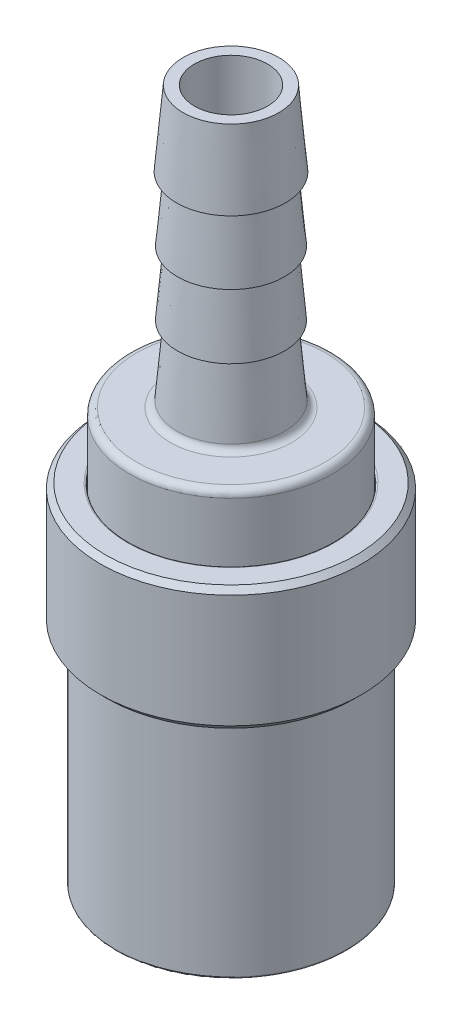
ISO-10303-21;
HEADER;
FILE_DESCRIPTION(('STEP AP214'),'2;1');
FILE_NAME('part.step','',(''),(''),'','','');
FILE_SCHEMA(('AUTOMOTIVE_DESIGN { 1 0 10303 214 1 1 1 1 }'));
ENDSEC;
DATA;
#1=APPLICATION_CONTEXT('core data for automotive mechanical design processes');
#2=APPLICATION_PROTOCOL_DEFINITION('international standard','automotive_design',2000,#1);
#3=PRODUCT_CONTEXT('',#1,'mechanical');
#4=PRODUCT('Part','Part','',(#3));
#5=PRODUCT_RELATED_PRODUCT_CATEGORY('part','',(#4));
#6=PRODUCT_DEFINITION_FORMATION('','',#4);
#7=PRODUCT_DEFINITION_CONTEXT('part definition',#1,'design');
#8=PRODUCT_DEFINITION('design','',#6,#7);
#9=PRODUCT_DEFINITION_SHAPE('','',#8);
#10=(LENGTH_UNIT() NAMED_UNIT(*) SI_UNIT(.MILLI.,.METRE.));
#11=(NAMED_UNIT(*) PLANE_ANGLE_UNIT() SI_UNIT($,.RADIAN.));
#12=(NAMED_UNIT(*) SI_UNIT($,.STERADIAN.) SOLID_ANGLE_UNIT());
#13=UNCERTAINTY_MEASURE_WITH_UNIT(LENGTH_MEASURE(1.E-05),#10,'distance_accuracy_value','');
#14=(GEOMETRIC_REPRESENTATION_CONTEXT(3) GLOBAL_UNCERTAINTY_ASSIGNED_CONTEXT((#13)) GLOBAL_UNIT_ASSIGNED_CONTEXT((#10,
#11,#12)) REPRESENTATION_CONTEXT('',''));
#15=CARTESIAN_POINT('',(0.,0.,0.));
#16=DIRECTION('',(0.,0.,1.));
#17=DIRECTION('',(1.,0.,0.));
#18=AXIS2_PLACEMENT_3D('',#15,#16,#17);
#19=CARTESIAN_POINT('',(0.,30.1498,-7.4041));
#20=DIRECTION('',(0.,1.,0.));
#21=DIRECTION('',(1.,0.,0.));
#22=AXIS2_PLACEMENT_3D('',#19,#20,#21);
#23=PLANE('',#22);
#24=CARTESIAN_POINT('',(0.,30.1498,0.));
#25=DIRECTION('',(0.,1.,0.));
#26=DIRECTION('',(0.,0.,1.));
#27=AXIS2_PLACEMENT_3D('',#24,#25,#26);
#28=CIRCLE('',#27,4.438540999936);
#29=CARTESIAN_POINT('',(0.,30.1498,4.438540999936));
#30=VERTEX_POINT('',#29);
#31=EDGE_CURVE('P0_E387',#30,#30,#28,.T.);
#32=ORIENTED_EDGE('',*,*,#31,.F.);
#33=EDGE_LOOP('',(#32));
#34=FACE_BOUND('',#33,.T.);
#35=CARTESIAN_POINT('',(0.,30.1498,0.));
#36=DIRECTION('',(0.,-1.,0.));
#37=DIRECTION('',(0.,0.,1.));
#38=AXIS2_PLACEMENT_3D('',#35,#36,#37);
#39=CIRCLE('',#38,6.8961);
#40=CARTESIAN_POINT('',(0.,30.1498,-6.8961));
#41=VERTEX_POINT('',#40);
#42=CARTESIAN_POINT('',(0.,30.1498,6.8961));
#43=VERTEX_POINT('',#42);
#44=EDGE_CURVE('P0_E32',#41,#43,#39,.T.);
#45=ORIENTED_EDGE('',*,*,#44,.F.);
#46=CARTESIAN_POINT('',(0.,30.1498,0.));
#47=DIRECTION('',(0.,-1.,0.));
#48=DIRECTION('',(0.,0.,1.));
#49=AXIS2_PLACEMENT_3D('',#46,#47,#48);
#50=CIRCLE('',#49,6.8961);
#51=EDGE_CURVE('P0_E170',#43,#41,#50,.T.);
#52=ORIENTED_EDGE('',*,*,#51,.F.);
#53=EDGE_LOOP('',(#45,#52));
#54=FACE_BOUND('',#53,.T.);
#55=ADVANCED_FACE('P0_F16',(#34,#54),#23,.T.);
#56=CARTESIAN_POINT('',(0.,29.6418,0.));
#57=DIRECTION('',(0.,-1.,0.));
#58=DIRECTION('',(0.,0.,-1.));
#59=AXIS2_PLACEMENT_3D('',#56,#57,#58);
#60=TOROIDAL_SURFACE('',#59,6.8961,0.508);
#61=CARTESIAN_POINT('',(0.,29.6418,0.));
#62=DIRECTION('',(0.,1.,0.));
#63=DIRECTION('',(0.,0.,1.));
#64=AXIS2_PLACEMENT_3D('',#61,#62,#63);
#65=CIRCLE('',#64,7.4041);
#66=CARTESIAN_POINT('',(0.,29.6418,-7.4041));
#67=VERTEX_POINT('',#66);
#68=CARTESIAN_POINT('',(0.,29.6418,7.4041));
#69=VERTEX_POINT('',#68);
#70=EDGE_CURVE('P0_E169',#67,#69,#65,.T.);
#71=ORIENTED_EDGE('',*,*,#70,.T.);
#72=CARTESIAN_POINT('',(0.,29.6418,6.8961));
#73=DIRECTION('',(-1.,0.,0.));
#74=DIRECTION('',(0.,0.,1.));
#75=AXIS2_PLACEMENT_3D('',#72,#73,#74);
#76=CIRCLE('',#75,0.508);
#77=EDGE_CURVE('P0_E166',#69,#43,#76,.T.);
#78=ORIENTED_EDGE('',*,*,#77,.T.);
#79=ORIENTED_EDGE('',*,*,#51,.T.);
#80=ORIENTED_EDGE('',*,*,#44,.T.);
#81=ORIENTED_EDGE('',*,*,#77,.F.);
#82=CARTESIAN_POINT('',(0.,29.6418,0.));
#83=DIRECTION('',(0.,1.,0.));
#84=DIRECTION('',(0.,0.,1.));
#85=AXIS2_PLACEMENT_3D('',#82,#83,#84);
#86=CIRCLE('',#85,7.4041);
#87=EDGE_CURVE('P0_E157',#69,#67,#86,.T.);
#88=ORIENTED_EDGE('',*,*,#87,.T.);
#89=EDGE_LOOP('',(#71,#78,#79,#80,#81,#88));
#90=FACE_BOUND('',#89,.T.);
#91=ADVANCED_FACE('P0_F310',(#90),#60,.T.);
#92=CARTESIAN_POINT('',(0.,22.6949,0.));
#93=DIRECTION('',(0.,-1.,0.));
#94=DIRECTION('',(0.,0.,-1.));
#95=AXIS2_PLACEMENT_3D('',#92,#93,#94);
#96=CYLINDRICAL_SURFACE('',#95,7.4041);
#97=DIRECTION('',(0.,1.,0.));
#98=VECTOR('',#97,1.);
#99=CARTESIAN_POINT('',(0.,22.6949,7.4041));
#100=LINE('',#99,#98);
#101=CARTESIAN_POINT('',(0.,15.24,7.4041));
#102=VERTEX_POINT('',#101);
#103=CARTESIAN_POINT('',(0.,25.3999996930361,7.4041));
#104=VERTEX_POINT('',#103);
#105=EDGE_CURVE('P0_E200',#102,#104,#100,.T.);
#106=ORIENTED_EDGE('',*,*,#105,.T.);
#107=ORIENTED_EDGE('',*,*,#105,.F.);
#108=CARTESIAN_POINT('',(0.,15.24,0.));
#109=DIRECTION('',(0.,-1.,0.));
#110=DIRECTION('',(1.,0.,0.));
#111=AXIS2_PLACEMENT_3D('',#108,#109,#110);
#112=CIRCLE('',#111,7.4041);
#113=CARTESIAN_POINT('',(0.,15.24,-7.4041));
#114=VERTEX_POINT('',#113);
#115=EDGE_CURVE('P0_E152',#114,#102,#112,.T.);
#116=ORIENTED_EDGE('',*,*,#115,.F.);
#117=CARTESIAN_POINT('',(0.,15.24,0.));
#118=DIRECTION('',(0.,-1.,0.));
#119=DIRECTION('',(1.,0.,0.));
#120=AXIS2_PLACEMENT_3D('',#117,#118,#119);
#121=CIRCLE('',#120,7.4041);
#122=EDGE_CURVE('P0_E148',#102,#114,#121,.T.);
#123=ORIENTED_EDGE('',*,*,#122,.F.);
#124=EDGE_LOOP('',(#106,#107,#116,#123));
#125=FACE_BOUND('',#124,.T.);
#126=DIRECTION('',(0.,1.,0.));
#127=VECTOR('',#126,1.);
#128=CARTESIAN_POINT('',(0.,22.6949,7.4041));
#129=LINE('',#128,#127);
#130=CARTESIAN_POINT('',(0.,28.1939996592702,7.4041));
#131=VERTEX_POINT('',#130);
#132=EDGE_CURVE('P0_E202',#131,#69,#129,.T.);
#133=ORIENTED_EDGE('',*,*,#132,.F.);
#134=ORIENTED_EDGE('',*,*,#132,.T.);
#135=ORIENTED_EDGE('',*,*,#70,.F.);
#136=ORIENTED_EDGE('',*,*,#87,.F.);
#137=EDGE_LOOP('',(#133,#134,#135,#136));
#138=FACE_BOUND('',#137,.T.);
#139=ADVANCED_FACE('P0_F306',(#125,#138),#96,.T.);
#140=CARTESIAN_POINT('',(0.,0.3937,0.));
#141=DIRECTION('',(0.,-1.,0.));
#142=DIRECTION('',(0.,0.,1.));
#143=AXIS2_PLACEMENT_3D('',#140,#141,#142);
#144=CONICAL_SURFACE('',#143,5.1689,0.785398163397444);
#145=CARTESIAN_POINT('',(0.,0.7874,0.));
#146=DIRECTION('',(0.,1.,0.));
#147=DIRECTION('',(0.,0.,1.));
#148=AXIS2_PLACEMENT_3D('',#145,#146,#147);
#149=CIRCLE('',#148,4.7752);
#150=CARTESIAN_POINT('',(0.,0.7874,-4.7752));
#151=VERTEX_POINT('',#150);
#152=CARTESIAN_POINT('',(0.,0.7874,4.7752));
#153=VERTEX_POINT('',#152);
#154=EDGE_CURVE('P0_E219',#151,#153,#149,.T.);
#155=ORIENTED_EDGE('',*,*,#154,.T.);
#156=CARTESIAN_POINT('',(0.,0.7874,0.));
#157=DIRECTION('',(0.,1.,0.));
#158=DIRECTION('',(0.,0.,1.));
#159=AXIS2_PLACEMENT_3D('',#156,#157,#158);
#160=CIRCLE('',#159,4.7752);
#161=EDGE_CURVE('P0_E254',#153,#151,#160,.T.);
#162=ORIENTED_EDGE('',*,*,#161,.T.);
#163=DIRECTION('',(0.,-0.70710678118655,-0.707106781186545));
#164=VECTOR('',#163,1.);
#165=CARTESIAN_POINT('',(0.,0.3937,-5.1689));
#166=LINE('',#165,#164);
#167=CARTESIAN_POINT('',(0.,0.,-5.5626));
#168=VERTEX_POINT('',#167);
#169=EDGE_CURVE('P0_E189',#151,#168,#166,.T.);
#170=ORIENTED_EDGE('',*,*,#169,.T.);
#171=CARTESIAN_POINT('',(0.,0.,0.));
#172=DIRECTION('',(0.,-1.,0.));
#173=DIRECTION('',(0.,0.,1.));
#174=AXIS2_PLACEMENT_3D('',#171,#172,#173);
#175=CIRCLE('',#174,5.5626);
#176=EDGE_CURVE('P0_E144',#168,#168,#175,.T.);
#177=ORIENTED_EDGE('',*,*,#176,.T.);
#178=ORIENTED_EDGE('',*,*,#169,.F.);
#179=EDGE_LOOP('',(#155,#162,#170,#177,#178));
#180=FACE_BOUND('',#179,.T.);
#181=ADVANCED_FACE('P0_F297',(#180),#144,.F.);
#182=CARTESIAN_POINT('',(0.,0.,-4.7752));
#183=DIRECTION('',(0.,-1.,0.));
#184=DIRECTION('',(0.,0.,-1.));
#185=AXIS2_PLACEMENT_3D('',#182,#183,#184);
#186=PLANE('',#185);
#187=CARTESIAN_POINT('',(0.,0.,0.));
#188=DIRECTION('',(0.,-1.,0.));
#189=DIRECTION('',(1.,0.,0.));
#190=AXIS2_PLACEMENT_3D('',#187,#188,#189);
#191=CIRCLE('',#190,6.35);
#192=CARTESIAN_POINT('',(0.,0.,-6.35));
#193=VERTEX_POINT('',#192);
#194=CARTESIAN_POINT('',(0.,0.,6.35));
#195=VERTEX_POINT('',#194);
#196=EDGE_CURVE('P0_E138',#193,#195,#191,.T.);
#197=ORIENTED_EDGE('',*,*,#196,.T.);
#198=CARTESIAN_POINT('',(0.,0.,0.));
#199=DIRECTION('',(0.,-1.,0.));
#200=DIRECTION('',(1.,0.,0.));
#201=AXIS2_PLACEMENT_3D('',#198,#199,#200);
#202=CIRCLE('',#201,6.35);
#203=EDGE_CURVE('P0_E132',#195,#193,#202,.T.);
#204=ORIENTED_EDGE('',*,*,#203,.T.);
#205=EDGE_LOOP('',(#197,#204));
#206=FACE_BOUND('',#205,.T.);
#207=ORIENTED_EDGE('',*,*,#176,.F.);
#208=EDGE_LOOP('',(#207));
#209=FACE_BOUND('',#208,.T.);
#210=ADVANCED_FACE('P0_F142',(#206,#209),#186,.T.);
#211=CARTESIAN_POINT('',(0.,4.05954229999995,0.));
#212=DIRECTION('',(0.,-1.,0.));
#213=DIRECTION('',(0.,0.,-1.));
#214=AXIS2_PLACEMENT_3D('',#211,#212,#213);
#215=CYLINDRICAL_SURFACE('',#214,4.7752);
#216=ORIENTED_EDGE('',*,*,#154,.F.);
#217=ORIENTED_EDGE('',*,*,#161,.F.);
#218=DIRECTION('',(0.,1.,0.));
#219=VECTOR('',#218,1.);
#220=CARTESIAN_POINT('',(0.,4.05954229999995,4.7752));
#221=LINE('',#220,#219);
#222=CARTESIAN_POINT('',(0.,8.1190845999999,4.7752));
#223=VERTEX_POINT('',#222);
#224=EDGE_CURVE('P0_E140',#153,#223,#221,.T.);
#225=ORIENTED_EDGE('',*,*,#224,.T.);
#226=CARTESIAN_POINT('',(0.,8.11908459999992,0.));
#227=DIRECTION('',(0.,-1.,0.));
#228=DIRECTION('',(1.,0.,0.));
#229=AXIS2_PLACEMENT_3D('',#226,#227,#228);
#230=CIRCLE('',#229,4.7752);
#231=CARTESIAN_POINT('',(0.,8.11908459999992,-4.7752));
#232=VERTEX_POINT('',#231);
#233=EDGE_CURVE('P0_E160',#232,#223,#230,.T.);
#234=ORIENTED_EDGE('',*,*,#233,.F.);
#235=CARTESIAN_POINT('',(0.,8.11908459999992,0.));
#236=DIRECTION('',(0.,-1.,0.));
#237=DIRECTION('',(1.,0.,0.));
#238=AXIS2_PLACEMENT_3D('',#235,#236,#237);
#239=CIRCLE('',#238,4.7752);
#240=EDGE_CURVE('P0_E237',#223,#232,#239,.T.);
#241=ORIENTED_EDGE('',*,*,#240,.F.);
#242=ORIENTED_EDGE('',*,*,#224,.F.);
#243=EDGE_LOOP('',(#216,#217,#225,#234,#241,#242));
#244=FACE_BOUND('',#243,.T.);
#245=ADVANCED_FACE('P0_F291',(#244),#215,.F.);
#246=CARTESIAN_POINT('',(0.,12.8524,-3.3782));
#247=DIRECTION('',(0.,-1.,0.));
#248=DIRECTION('',(0.,0.,-1.));
#249=AXIS2_PLACEMENT_3D('',#246,#247,#248);
#250=PLANE('',#249);
#251=CARTESIAN_POINT('',(0.,12.8524,0.));
#252=DIRECTION('',(0.,-1.,0.));
#253=DIRECTION('',(1.,0.,0.));
#254=AXIS2_PLACEMENT_3D('',#251,#252,#253);
#255=CIRCLE('',#254,5.0546);
#256=CARTESIAN_POINT('',(0.,12.8524,-5.0546));
#257=VERTEX_POINT('',#256);
#258=CARTESIAN_POINT('',(0.,12.8524,5.0546));
#259=VERTEX_POINT('',#258);
#260=EDGE_CURVE('P0_E246',#257,#259,#255,.T.);
#261=ORIENTED_EDGE('',*,*,#260,.T.);
#262=CARTESIAN_POINT('',(0.,12.8524,0.));
#263=DIRECTION('',(0.,-1.,0.));
#264=DIRECTION('',(1.,0.,0.));
#265=AXIS2_PLACEMENT_3D('',#262,#263,#264);
#266=CIRCLE('',#265,5.0546);
#267=EDGE_CURVE('P0_E232',#259,#257,#266,.T.);
#268=ORIENTED_EDGE('',*,*,#267,.T.);
#269=EDGE_LOOP('',(#261,#268));
#270=FACE_BOUND('',#269,.T.);
#271=CARTESIAN_POINT('',(0.,12.8524,0.));
#272=DIRECTION('',(0.,-1.,0.));
#273=DIRECTION('',(1.,0.,0.));
#274=AXIS2_PLACEMENT_3D('',#271,#272,#273);
#275=CIRCLE('',#274,3.3782);
#276=CARTESIAN_POINT('',(0.,12.8524,-3.3782));
#277=VERTEX_POINT('',#276);
#278=CARTESIAN_POINT('',(0.,12.8524,3.3782));
#279=VERTEX_POINT('',#278);
#280=EDGE_CURVE('P0_E225',#277,#279,#275,.T.);
#281=ORIENTED_EDGE('',*,*,#280,.F.);
#282=CARTESIAN_POINT('',(0.,12.8524,0.));
#283=DIRECTION('',(0.,-1.,0.));
#284=DIRECTION('',(1.,0.,0.));
#285=AXIS2_PLACEMENT_3D('',#282,#283,#284);
#286=CIRCLE('',#285,3.3782);
#287=EDGE_CURVE('P0_E226',#279,#277,#286,.T.);
#288=ORIENTED_EDGE('',*,*,#287,.F.);
#289=EDGE_LOOP('',(#281,#288));
#290=FACE_BOUND('',#289,.T.);
#291=ADVANCED_FACE('P0_F269',(#270,#290),#250,.T.);
#292=CARTESIAN_POINT('',(0.,19.9137147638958,0.));
#293=DIRECTION('',(0.,-1.,0.));
#294=DIRECTION('',(0.,0.,-1.));
#295=AXIS2_PLACEMENT_3D('',#292,#293,#294);
#296=CYLINDRICAL_SURFACE('',#295,3.3782);
#297=ORIENTED_EDGE('',*,*,#280,.T.);
#298=DIRECTION('',(0.,1.,0.));
#299=VECTOR('',#298,1.);
#300=CARTESIAN_POINT('',(0.,19.9137147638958,3.3782));
#301=LINE('',#300,#299);
#302=CARTESIAN_POINT('',(0.,26.9750295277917,3.3782));
#303=VERTEX_POINT('',#302);
#304=EDGE_CURVE('P0_E222',#279,#303,#301,.T.);
#305=ORIENTED_EDGE('',*,*,#304,.T.);
#306=CARTESIAN_POINT('',(0.,26.9750295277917,0.));
#307=DIRECTION('',(0.,-1.,0.));
#308=DIRECTION('',(1.,0.,0.));
#309=AXIS2_PLACEMENT_3D('',#306,#307,#308);
#310=CIRCLE('',#309,3.3782);
#311=CARTESIAN_POINT('',(0.,26.9750295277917,-3.3782));
#312=VERTEX_POINT('',#311);
#313=EDGE_CURVE('P0_E186',#312,#303,#310,.T.);
#314=ORIENTED_EDGE('',*,*,#313,.F.);
#315=CARTESIAN_POINT('',(0.,26.9750295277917,0.));
#316=DIRECTION('',(0.,-1.,0.));
#317=DIRECTION('',(1.,0.,0.));
#318=AXIS2_PLACEMENT_3D('',#315,#316,#317);
#319=CIRCLE('',#318,3.3782);
#320=EDGE_CURVE('P0_E164',#303,#312,#319,.T.);
#321=ORIENTED_EDGE('',*,*,#320,.F.);
#322=ORIENTED_EDGE('',*,*,#304,.F.);
#323=ORIENTED_EDGE('',*,*,#287,.T.);
#324=EDGE_LOOP('',(#297,#305,#314,#321,#322,#323));
#325=FACE_BOUND('',#324,.T.);
#326=ADVANCED_FACE('P0_F398',(#325),#296,.F.);
#327=CARTESIAN_POINT('',(0.,26.9750295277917,-2.57765313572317));
#328=DIRECTION('',(0.,-1.,0.));
#329=DIRECTION('',(0.,0.,-1.));
#330=AXIS2_PLACEMENT_3D('',#327,#328,#329);
#331=PLANE('',#330);
#332=CARTESIAN_POINT('',(0.,26.9750295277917,0.));
#333=DIRECTION('',(0.,-1.,0.));
#334=DIRECTION('',(0.,0.,-1.));
#335=AXIS2_PLACEMENT_3D('',#332,#333,#334);
#336=CIRCLE('',#335,2.667);
#337=CARTESIAN_POINT('',(0.,26.9750295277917,-2.667));
#338=VERTEX_POINT('',#337);
#339=EDGE_CURVE('P0_E368',#338,#338,#336,.T.);
#340=ORIENTED_EDGE('',*,*,#339,.F.);
#341=EDGE_LOOP('',(#340));
#342=FACE_BOUND('',#341,.T.);
#343=ORIENTED_EDGE('',*,*,#313,.T.);
#344=ORIENTED_EDGE('',*,*,#320,.T.);
#345=EDGE_LOOP('',(#343,#344));
#346=FACE_BOUND('',#345,.T.);
#347=ADVANCED_FACE('P0_F404',(#342,#346),#331,.T.);
#348=CARTESIAN_POINT('',(0.,15.24,-6.35));
#349=DIRECTION('',(0.,-1.,0.));
#350=DIRECTION('',(0.,0.,-1.));
#351=AXIS2_PLACEMENT_3D('',#348,#349,#350);
#352=PLANE('',#351);
#353=ORIENTED_EDGE('',*,*,#115,.T.);
#354=ORIENTED_EDGE('',*,*,#122,.T.);
#355=EDGE_LOOP('',(#353,#354));
#356=FACE_BOUND('',#355,.T.);
#357=CARTESIAN_POINT('',(0.,15.24,0.));
#358=DIRECTION('',(0.,-1.,0.));
#359=DIRECTION('',(1.,0.,0.));
#360=AXIS2_PLACEMENT_3D('',#357,#358,#359);
#361=CIRCLE('',#360,6.35);
#362=CARTESIAN_POINT('',(0.,15.24,-6.35));
#363=VERTEX_POINT('',#362);
#364=CARTESIAN_POINT('',(0.,15.24,6.35));
#365=VERTEX_POINT('',#364);
#366=EDGE_CURVE('P0_E146',#363,#365,#361,.T.);
#367=ORIENTED_EDGE('',*,*,#366,.F.);
#368=CARTESIAN_POINT('',(0.,15.24,0.));
#369=DIRECTION('',(0.,-1.,0.));
#370=DIRECTION('',(1.,0.,0.));
#371=AXIS2_PLACEMENT_3D('',#368,#369,#370);
#372=CIRCLE('',#371,6.35);
#373=EDGE_CURVE('P0_E149',#365,#363,#372,.T.);
#374=ORIENTED_EDGE('',*,*,#373,.F.);
#375=EDGE_LOOP('',(#367,#374));
#376=FACE_BOUND('',#375,.T.);
#377=ADVANCED_FACE('P0_F321',(#356,#376),#352,.T.);
#378=CARTESIAN_POINT('',(0.,7.62,0.));
#379=DIRECTION('',(0.,-1.,0.));
#380=DIRECTION('',(0.,0.,-1.));
#381=AXIS2_PLACEMENT_3D('',#378,#379,#380);
#382=CYLINDRICAL_SURFACE('',#381,6.35);
#383=ORIENTED_EDGE('',*,*,#196,.F.);
#384=ORIENTED_EDGE('',*,*,#203,.F.);
#385=DIRECTION('',(0.,1.,0.));
#386=VECTOR('',#385,1.);
#387=CARTESIAN_POINT('',(0.,7.62,6.35));
#388=LINE('',#387,#386);
#389=EDGE_CURVE('P0_E137',#195,#365,#388,.T.);
#390=ORIENTED_EDGE('',*,*,#389,.T.);
#391=ORIENTED_EDGE('',*,*,#373,.T.);
#392=ORIENTED_EDGE('',*,*,#366,.T.);
#393=ORIENTED_EDGE('',*,*,#389,.F.);
#394=EDGE_LOOP('',(#383,#384,#390,#391,#392,#393));
#395=FACE_BOUND('',#394,.T.);
#396=ADVANCED_FACE('P0_F134',(#395),#382,.T.);
#397=CARTESIAN_POINT('',(0.,8.19974043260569,0.));
#398=DIRECTION('',(0.,1.,0.));
#399=DIRECTION('',(0.,0.,-1.));
#400=AXIS2_PLACEMENT_3D('',#397,#398,#399);
#401=CONICAL_SURFACE('',#400,4.9149,1.0471975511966);
#402=ORIENTED_EDGE('',*,*,#233,.T.);
#403=DIRECTION('',(0.,0.5,0.86602540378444));
#404=VECTOR('',#403,1.);
#405=CARTESIAN_POINT('',(0.,8.19974043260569,4.9149));
#406=LINE('',#405,#404);
#407=CARTESIAN_POINT('',(0.,8.28039626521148,5.0546));
#408=VERTEX_POINT('',#407);
#409=EDGE_CURVE('P0_E234',#223,#408,#406,.T.);
#410=ORIENTED_EDGE('',*,*,#409,.T.);
#411=CARTESIAN_POINT('',(0.,8.28039626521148,0.));
#412=DIRECTION('',(0.,-1.,0.));
#413=DIRECTION('',(1.,0.,0.));
#414=AXIS2_PLACEMENT_3D('',#411,#412,#413);
#415=CIRCLE('',#414,5.0546);
#416=CARTESIAN_POINT('',(0.,8.28039626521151,-5.0546));
#417=VERTEX_POINT('',#416);
#418=EDGE_CURVE('P0_E206',#417,#408,#415,.T.);
#419=ORIENTED_EDGE('',*,*,#418,.F.);
#420=CARTESIAN_POINT('',(0.,8.28039626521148,0.));
#421=DIRECTION('',(0.,-1.,0.));
#422=DIRECTION('',(1.,0.,0.));
#423=AXIS2_PLACEMENT_3D('',#420,#421,#422);
#424=CIRCLE('',#423,5.0546);
#425=EDGE_CURVE('P0_E207',#408,#417,#424,.T.);
#426=ORIENTED_EDGE('',*,*,#425,.F.);
#427=ORIENTED_EDGE('',*,*,#409,.F.);
#428=ORIENTED_EDGE('',*,*,#240,.T.);
#429=EDGE_LOOP('',(#402,#410,#419,#426,#427,#428));
#430=FACE_BOUND('',#429,.T.);
#431=ADVANCED_FACE('P0_F287',(#430),#401,.F.);
#432=CARTESIAN_POINT('',(0.,8.73912166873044,0.));
#433=DIRECTION('',(0.,-1.,0.));
#434=DIRECTION('',(0.,0.,-1.));
#435=AXIS2_PLACEMENT_3D('',#432,#433,#434);
#436=CYLINDRICAL_SURFACE('',#435,5.0546);
#437=ORIENTED_EDGE('',*,*,#418,.T.);
#438=DIRECTION('',(0.,1.,0.));
#439=VECTOR('',#438,1.);
#440=CARTESIAN_POINT('',(0.,8.73912166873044,5.0546));
#441=LINE('',#440,#439);
#442=CARTESIAN_POINT('',(0.,9.1978470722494,5.0546));
#443=VERTEX_POINT('',#442);
#444=EDGE_CURVE('P0_E203',#408,#443,#441,.T.);
#445=ORIENTED_EDGE('',*,*,#444,.T.);
#446=CARTESIAN_POINT('',(0.,9.1978470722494,0.));
#447=DIRECTION('',(0.,-1.,0.));
#448=DIRECTION('',(1.,0.,0.));
#449=AXIS2_PLACEMENT_3D('',#446,#447,#448);
#450=CIRCLE('',#449,5.0546);
#451=CARTESIAN_POINT('',(0.,9.19784707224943,-5.0546));
#452=VERTEX_POINT('',#451);
#453=EDGE_CURVE('P0_E196',#452,#443,#450,.T.);
#454=ORIENTED_EDGE('',*,*,#453,.F.);
#455=CARTESIAN_POINT('',(0.,9.1978470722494,0.));
#456=DIRECTION('',(0.,-1.,0.));
#457=DIRECTION('',(1.,0.,0.));
#458=AXIS2_PLACEMENT_3D('',#455,#456,#457);
#459=CIRCLE('',#458,5.0546);
#460=EDGE_CURVE('P0_E197',#443,#452,#459,.T.);
#461=ORIENTED_EDGE('',*,*,#460,.F.);
#462=ORIENTED_EDGE('',*,*,#444,.F.);
#463=ORIENTED_EDGE('',*,*,#425,.T.);
#464=EDGE_LOOP('',(#437,#445,#454,#461,#462,#463));
#465=FACE_BOUND('',#464,.T.);
#466=ADVANCED_FACE('P0_F284',(#465),#436,.F.);
#467=CARTESIAN_POINT('',(0.,9.35256261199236,0.));
#468=DIRECTION('',(0.,1.,0.));
#469=DIRECTION('',(0.,0.,-1.));
#470=AXIS2_PLACEMENT_3D('',#467,#468,#469);
#471=CONICAL_SURFACE('',#470,5.2578,0.920041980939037);
#472=ORIENTED_EDGE('',*,*,#453,.T.);
#473=DIRECTION('',(0.,0.605786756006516,0.795627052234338));
#474=VECTOR('',#473,1.);
#475=CARTESIAN_POINT('',(0.,9.35256261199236,5.2578));
#476=LINE('',#475,#474);
#477=CARTESIAN_POINT('',(0.,9.50727815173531,5.461));
#478=VERTEX_POINT('',#477);
#479=EDGE_CURVE('P0_E194',#443,#478,#476,.T.);
#480=ORIENTED_EDGE('',*,*,#479,.T.);
#481=CARTESIAN_POINT('',(0.,9.50727815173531,0.));
#482=DIRECTION('',(0.,-1.,0.));
#483=DIRECTION('',(1.,0.,0.));
#484=AXIS2_PLACEMENT_3D('',#481,#482,#483);
#485=CIRCLE('',#484,5.461);
#486=CARTESIAN_POINT('',(0.,9.50727815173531,-5.461));
#487=VERTEX_POINT('',#486);
#488=EDGE_CURVE('P0_E243',#487,#478,#485,.T.);
#489=ORIENTED_EDGE('',*,*,#488,.F.);
#490=CARTESIAN_POINT('',(0.,9.50727815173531,0.));
#491=DIRECTION('',(0.,-1.,0.));
#492=DIRECTION('',(1.,0.,0.));
#493=AXIS2_PLACEMENT_3D('',#490,#491,#492);
#494=CIRCLE('',#493,5.461);
#495=EDGE_CURVE('P0_E174',#478,#487,#494,.T.);
#496=ORIENTED_EDGE('',*,*,#495,.F.);
#497=ORIENTED_EDGE('',*,*,#479,.F.);
#498=ORIENTED_EDGE('',*,*,#460,.T.);
#499=EDGE_LOOP('',(#472,#480,#489,#496,#497,#498));
#500=FACE_BOUND('',#499,.T.);
#501=ADVANCED_FACE('P0_F18',(#500),#471,.F.);
#502=CARTESIAN_POINT('',(0.,10.4597781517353,0.));
#503=DIRECTION('',(0.,-1.,0.));
#504=DIRECTION('',(0.,0.,-1.));
#505=AXIS2_PLACEMENT_3D('',#502,#503,#504);
#506=CYLINDRICAL_SURFACE('',#505,5.461);
#507=ORIENTED_EDGE('',*,*,#488,.T.);
#508=DIRECTION('',(0.,1.,0.));
#509=VECTOR('',#508,1.);
#510=CARTESIAN_POINT('',(0.,10.4597781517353,5.461));
#511=LINE('',#510,#509);
#512=CARTESIAN_POINT('',(0.,11.4122781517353,5.461));
#513=VERTEX_POINT('',#512);
#514=EDGE_CURVE('P0_E178',#478,#513,#511,.T.);
#515=ORIENTED_EDGE('',*,*,#514,.T.);
#516=CARTESIAN_POINT('',(0.,11.4122781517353,0.));
#517=DIRECTION('',(0.,-1.,0.));
#518=DIRECTION('',(1.,0.,0.));
#519=AXIS2_PLACEMENT_3D('',#516,#517,#518);
#520=CIRCLE('',#519,5.461);
#521=CARTESIAN_POINT('',(0.,11.4122781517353,-5.461));
#522=VERTEX_POINT('',#521);
#523=EDGE_CURVE('P0_E171',#522,#513,#520,.T.);
#524=ORIENTED_EDGE('',*,*,#523,.F.);
#525=CARTESIAN_POINT('',(0.,11.4122781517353,0.));
#526=DIRECTION('',(0.,-1.,0.));
#527=DIRECTION('',(1.,0.,0.));
#528=AXIS2_PLACEMENT_3D('',#525,#526,#527);
#529=CIRCLE('',#528,5.461);
#530=EDGE_CURVE('P0_E193',#513,#522,#529,.T.);
#531=ORIENTED_EDGE('',*,*,#530,.F.);
#532=ORIENTED_EDGE('',*,*,#514,.F.);
#533=ORIENTED_EDGE('',*,*,#495,.T.);
#534=EDGE_LOOP('',(#507,#515,#524,#531,#532,#533));
#535=FACE_BOUND('',#534,.T.);
#536=ADVANCED_FACE('P0_F279',(#535),#506,.F.);
#537=CARTESIAN_POINT('',(0.,11.4973390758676,0.));
#538=DIRECTION('',(0.,-1.,0.));
#539=DIRECTION('',(0.,0.,-1.));
#540=AXIS2_PLACEMENT_3D('',#537,#538,#539);
#541=CONICAL_SURFACE('',#540,5.2578,1.17435312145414);
#542=ORIENTED_EDGE('',*,*,#523,.T.);
#543=DIRECTION('',(0.,0.386139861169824,-0.92244024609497));
#544=VECTOR('',#543,1.);
#545=CARTESIAN_POINT('',(0.,11.4973390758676,5.2578));
#546=LINE('',#545,#544);
#547=CARTESIAN_POINT('',(0.,11.5824,5.0546));
#548=VERTEX_POINT('',#547);
#549=EDGE_CURVE('P0_E175',#513,#548,#546,.T.);
#550=ORIENTED_EDGE('',*,*,#549,.T.);
#551=CARTESIAN_POINT('',(0.,11.5824,0.));
#552=DIRECTION('',(0.,-1.,0.));
#553=DIRECTION('',(1.,0.,0.));
#554=AXIS2_PLACEMENT_3D('',#551,#552,#553);
#555=CIRCLE('',#554,5.0546);
#556=CARTESIAN_POINT('',(0.,11.5824,-5.0546));
#557=VERTEX_POINT('',#556);
#558=EDGE_CURVE('P0_E190',#557,#548,#555,.T.);
#559=ORIENTED_EDGE('',*,*,#558,.F.);
#560=CARTESIAN_POINT('',(0.,11.5824,0.));
#561=DIRECTION('',(0.,-1.,0.));
#562=DIRECTION('',(1.,0.,0.));
#563=AXIS2_PLACEMENT_3D('',#560,#561,#562);
#564=CIRCLE('',#563,5.0546);
#565=EDGE_CURVE('P0_E179',#548,#557,#564,.T.);
#566=ORIENTED_EDGE('',*,*,#565,.F.);
#567=ORIENTED_EDGE('',*,*,#549,.F.);
#568=ORIENTED_EDGE('',*,*,#530,.T.);
#569=EDGE_LOOP('',(#542,#550,#559,#566,#567,#568));
#570=FACE_BOUND('',#569,.T.);
#571=ADVANCED_FACE('P0_F276',(#570),#541,.F.);
#572=CARTESIAN_POINT('',(0.,12.2174,0.));
#573=DIRECTION('',(0.,-1.,0.));
#574=DIRECTION('',(0.,0.,-1.));
#575=AXIS2_PLACEMENT_3D('',#572,#573,#574);
#576=CYLINDRICAL_SURFACE('',#575,5.0546);
#577=ORIENTED_EDGE('',*,*,#558,.T.);
#578=DIRECTION('',(0.,1.,0.));
#579=VECTOR('',#578,1.);
#580=CARTESIAN_POINT('',(0.,12.2174,5.0546));
#581=LINE('',#580,#579);
#582=EDGE_CURVE('P0_E182',#548,#259,#581,.T.);
#583=ORIENTED_EDGE('',*,*,#582,.T.);
#584=ORIENTED_EDGE('',*,*,#260,.F.);
#585=ORIENTED_EDGE('',*,*,#267,.F.);
#586=ORIENTED_EDGE('',*,*,#582,.F.);
#587=ORIENTED_EDGE('',*,*,#565,.T.);
#588=EDGE_LOOP('',(#577,#583,#584,#585,#586,#587));
#589=FACE_BOUND('',#588,.T.);
#590=ADVANCED_FACE('P0_F273',(#589),#576,.F.);
#591=CARTESIAN_POINT('',(0.,35.6645838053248,0.));
#592=DIRECTION('',(0.,-1.,0.));
#593=DIRECTION('',(0.,0.,-1.));
#594=AXIS2_PLACEMENT_3D('',#591,#592,#593);
#595=CONICAL_SURFACE('',#594,3.49055061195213,0.0872690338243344);
#596=CARTESIAN_POINT('',(0.,35.6614434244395,0.));
#597=DIRECTION('',(0.,-1.,0.));
#598=DIRECTION('',(0.,0.,-1.));
#599=AXIS2_PLACEMENT_3D('',#596,#597,#598);
#600=CIRCLE('',#599,3.49082536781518);
#601=CARTESIAN_POINT('',(0.,35.6614434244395,3.49082536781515));
#602=VERTEX_POINT('',#601);
#603=EDGE_CURVE('P0_E25',#602,#602,#600,.T.);
#604=ORIENTED_EDGE('',*,*,#603,.T.);
#605=EDGE_LOOP('',(#604));
#606=FACE_BOUND('',#605,.T.);
#607=CARTESIAN_POINT('',(0.,30.6135235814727,0.));
#608=DIRECTION('',(0.,1.,0.));
#609=DIRECTION('',(0.,0.,1.));
#610=AXIS2_PLACEMENT_3D('',#607,#608,#609);
#611=CIRCLE('',#610,3.93247420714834);
#612=CARTESIAN_POINT('',(0.,30.6135235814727,3.93247420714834));
#613=VERTEX_POINT('',#612);
#614=EDGE_CURVE('P0_E384',#613,#613,#611,.T.);
#615=ORIENTED_EDGE('',*,*,#614,.T.);
#616=EDGE_LOOP('',(#615));
#617=FACE_BOUND('',#616,.T.);
#618=ADVANCED_FACE('P0_F342',(#606,#617),#595,.T.);
#619=CARTESIAN_POINT('',(0.,30.6578,0.));
#620=DIRECTION('',(0.,1.,0.));
#621=DIRECTION('',(0.,0.,1.));
#622=AXIS2_PLACEMENT_3D('',#619,#620,#621);
#623=TOROIDAL_SURFACE('',#622,4.438540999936,0.508);
#624=ORIENTED_EDGE('',*,*,#31,.T.);
#625=EDGE_LOOP('',(#624));
#626=FACE_BOUND('',#625,.T.);
#627=ORIENTED_EDGE('',*,*,#614,.F.);
#628=EDGE_LOOP('',(#627));
#629=FACE_BOUND('',#628,.T.);
#630=ADVANCED_FACE('P0_F334',(#626,#629),#623,.F.);
#631=CARTESIAN_POINT('',(0.,50.5195426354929,0.));
#632=DIRECTION('',(0.,-1.,0.));
#633=DIRECTION('',(0.,0.,-1.));
#634=AXIS2_PLACEMENT_3D('',#631,#632,#633);
#635=CONICAL_SURFACE('',#634,3.49055061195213,0.0872690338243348);
#636=CARTESIAN_POINT('',(0.,45.0538604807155,0.));
#637=DIRECTION('',(0.,1.,0.));
#638=DIRECTION('',(0.,0.,1.));
#639=AXIS2_PLACEMENT_3D('',#636,#637,#638);
#640=CIRCLE('',#639,3.96875);
#641=CARTESIAN_POINT('',(0.,45.0538604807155,3.96875));
#642=VERTEX_POINT('',#641);
#643=EDGE_CURVE('P0_E183',#642,#642,#640,.T.);
#644=ORIENTED_EDGE('',*,*,#643,.T.);
#645=EDGE_LOOP('',(#644));
#646=FACE_BOUND('',#645,.T.);
#647=CARTESIAN_POINT('',(0.,50.5195426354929,0.));
#648=DIRECTION('',(0.,1.,0.));
#649=DIRECTION('',(0.,0.,1.));
#650=AXIS2_PLACEMENT_3D('',#647,#648,#649);
#651=CIRCLE('',#650,3.49055061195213);
#652=CARTESIAN_POINT('',(0.,50.5195426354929,3.49055061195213));
#653=VERTEX_POINT('',#652);
#654=EDGE_CURVE('P0_E390',#653,#653,#651,.T.);
#655=ORIENTED_EDGE('',*,*,#654,.F.);
#656=EDGE_LOOP('',(#655));
#657=FACE_BOUND('',#656,.T.);
#658=ADVANCED_FACE('P0_F330',(#646,#657),#635,.T.);
#659=CARTESIAN_POINT('',(-2.57765313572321,50.5195426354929,0.));
#660=DIRECTION('',(0.,1.,0.));
#661=DIRECTION('',(0.,0.,1.));
#662=AXIS2_PLACEMENT_3D('',#659,#660,#661);
#663=PLANE('',#662);
#664=CARTESIAN_POINT('',(0.,50.5195426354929,0.));
#665=DIRECTION('',(0.,1.,0.));
#666=DIRECTION('',(0.,0.,1.));
#667=AXIS2_PLACEMENT_3D('',#664,#665,#666);
#668=CIRCLE('',#667,2.667);
#669=CARTESIAN_POINT('',(0.,50.5195426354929,2.667));
#670=VERTEX_POINT('',#669);
#671=EDGE_CURVE('P0_E371',#670,#670,#668,.T.);
#672=ORIENTED_EDGE('',*,*,#671,.F.);
#673=EDGE_LOOP('',(#672));
#674=FACE_BOUND('',#673,.T.);
#675=ORIENTED_EDGE('',*,*,#654,.T.);
#676=EDGE_LOOP('',(#675));
#677=FACE_BOUND('',#676,.T.);
#678=ADVANCED_FACE('P0_F333',(#674,#677),#663,.T.);
#679=CARTESIAN_POINT('',(0.,35.6602290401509,0.));
#680=DIRECTION('',(0.,1.,0.));
#681=DIRECTION('',(0.,0.,-1.));
#682=AXIS2_PLACEMENT_3D('',#679,#680,#681);
#683=CONICAL_SURFACE('',#682,3.42186043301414,1.55318942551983);
#684=ORIENTED_EDGE('',*,*,#603,.F.);
#685=DIRECTION('',(0.,0.0176059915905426,0.999845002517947));
#686=VECTOR('',#685,1.);
#687=CARTESIAN_POINT('',(0.,35.6602290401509,3.42186043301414));
#688=LINE('',#687,#686);
#689=CARTESIAN_POINT('',(0.,35.6645838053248,3.66916773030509));
#690=VERTEX_POINT('',#689);
#691=EDGE_CURVE('P0_E161',#602,#690,#688,.T.);
#692=ORIENTED_EDGE('',*,*,#691,.T.);
#693=CARTESIAN_POINT('',(0.,35.6645838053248,0.));
#694=DIRECTION('',(0.,-1.,0.));
#695=DIRECTION('',(1.,0.,0.));
#696=AXIS2_PLACEMENT_3D('',#693,#694,#695);
#697=CIRCLE('',#696,3.66916773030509);
#698=EDGE_CURVE('P0_E165',#690,#690,#697,.T.);
#699=ORIENTED_EDGE('',*,*,#698,.T.);
#700=ORIENTED_EDGE('',*,*,#691,.F.);
#701=EDGE_LOOP('',(#684,#692,#699,#700));
#702=FACE_BOUND('',#701,.T.);
#703=ADVANCED_FACE('P0_F338',(#702),#683,.T.);
#704=CARTESIAN_POINT('',(0.,45.0538604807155,0.));
#705=DIRECTION('',(0.,-1.,0.));
#706=DIRECTION('',(0.,0.,-1.));
#707=AXIS2_PLACEMENT_3D('',#704,#705,#706);
#708=CONICAL_SURFACE('',#707,3.49055061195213,0.0872690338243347);
#709=CARTESIAN_POINT('',(0.,40.3548604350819,0.));
#710=DIRECTION('',(0.,1.,0.));
#711=DIRECTION('',(0.,0.,1.));
#712=AXIS2_PLACEMENT_3D('',#709,#710,#711);
#713=CIRCLE('',#712,3.90167202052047);
#714=CARTESIAN_POINT('',(0.,40.3548604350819,3.90167202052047));
#715=VERTEX_POINT('',#714);
#716=EDGE_CURVE('P0_E373',#715,#715,#713,.T.);
#717=ORIENTED_EDGE('',*,*,#716,.T.);
#718=EDGE_LOOP('',(#717));
#719=FACE_BOUND('',#718,.T.);
#720=CARTESIAN_POINT('',(0.,45.0538604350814,0.));
#721=DIRECTION('',(0.,-1.,0.));
#722=DIRECTION('',(0.,0.,-1.));
#723=AXIS2_PLACEMENT_3D('',#720,#721,#722);
#724=CIRCLE('',#723,3.49055061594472);
#725=CARTESIAN_POINT('',(0.,45.0538604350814,-3.49055061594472));
#726=VERTEX_POINT('',#725);
#727=EDGE_CURVE('P0_E11',#726,#726,#724,.T.);
#728=ORIENTED_EDGE('',*,*,#727,.T.);
#729=EDGE_LOOP('',(#728));
#730=FACE_BOUND('',#729,.T.);
#731=ADVANCED_FACE('P0_F353',(#719,#730),#708,.T.);
#732=CARTESIAN_POINT('',(0.,40.3548604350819,0.));
#733=DIRECTION('',(0.,-1.,0.));
#734=DIRECTION('',(0.,0.,-1.));
#735=AXIS2_PLACEMENT_3D('',#732,#733,#734);
#736=CONICAL_SURFACE('',#735,3.49055061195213,0.0872690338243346);
#737=CARTESIAN_POINT('',(0.,35.6645838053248,0.));
#738=DIRECTION('',(0.,1.,0.));
#739=DIRECTION('',(0.,0.,1.));
#740=AXIS2_PLACEMENT_3D('',#737,#738,#739);
#741=CIRCLE('',#740,3.90090879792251);
#742=CARTESIAN_POINT('',(0.,35.6645838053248,3.90090879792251));
#743=VERTEX_POINT('',#742);
#744=EDGE_CURVE('P0_E381',#743,#743,#741,.T.);
#745=ORIENTED_EDGE('',*,*,#744,.T.);
#746=EDGE_LOOP('',(#745));
#747=FACE_BOUND('',#746,.T.);
#748=CARTESIAN_POINT('',(0.,40.3548604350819,0.));
#749=DIRECTION('',(0.,1.,0.));
#750=DIRECTION('',(0.,0.,1.));
#751=AXIS2_PLACEMENT_3D('',#748,#749,#750);
#752=CIRCLE('',#751,3.49055061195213);
#753=CARTESIAN_POINT('',(0.,40.3548604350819,3.49055061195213));
#754=VERTEX_POINT('',#753);
#755=EDGE_CURVE('P0_E378',#754,#754,#752,.T.);
#756=ORIENTED_EDGE('',*,*,#755,.F.);
#757=EDGE_LOOP('',(#756));
#758=FACE_BOUND('',#757,.T.);
#759=ADVANCED_FACE('P0_F349',(#747,#758),#736,.T.);
#760=CARTESIAN_POINT('',(-3.90090879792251,35.6645838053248,0.));
#761=DIRECTION('',(0.,-1.,0.));
#762=DIRECTION('',(0.,0.,-1.));
#763=AXIS2_PLACEMENT_3D('',#760,#761,#762);
#764=PLANE('',#763);
#765=ORIENTED_EDGE('',*,*,#698,.F.);
#766=EDGE_LOOP('',(#765));
#767=FACE_BOUND('',#766,.T.);
#768=ORIENTED_EDGE('',*,*,#744,.F.);
#769=EDGE_LOOP('',(#768));
#770=FACE_BOUND('',#769,.T.);
#771=ADVANCED_FACE('P0_F346',(#767,#770),#764,.T.);
#772=CARTESIAN_POINT('',(-3.90167202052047,40.3548604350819,0.));
#773=DIRECTION('',(0.,-1.,0.));
#774=DIRECTION('',(0.,0.,-1.));
#775=AXIS2_PLACEMENT_3D('',#772,#773,#774);
#776=PLANE('',#775);
#777=ORIENTED_EDGE('',*,*,#755,.T.);
#778=EDGE_LOOP('',(#777));
#779=FACE_BOUND('',#778,.T.);
#780=ORIENTED_EDGE('',*,*,#716,.F.);
#781=EDGE_LOOP('',(#780));
#782=FACE_BOUND('',#781,.T.);
#783=ADVANCED_FACE('P0_F326',(#779,#782),#776,.T.);
#784=CARTESIAN_POINT('',(0.,45.0538604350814,-3.17455289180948));
#785=DIRECTION('',(0.,-1.,0.));
#786=DIRECTION('',(0.,0.,-1.));
#787=AXIS2_PLACEMENT_3D('',#784,#785,#786);
#788=PLANE('',#787);
#789=ORIENTED_EDGE('',*,*,#727,.F.);
#790=EDGE_LOOP('',(#789));
#791=FACE_BOUND('',#790,.T.);
#792=ORIENTED_EDGE('',*,*,#643,.F.);
#793=EDGE_LOOP('',(#792));
#794=FACE_BOUND('',#793,.T.);
#795=ADVANCED_FACE('P0_F322',(#791,#794),#788,.T.);
#796=CARTESIAN_POINT('',(0.,0.,0.));
#797=DIRECTION('',(0.,1.,0.));
#798=DIRECTION('',(0.,0.,1.));
#799=AXIS2_PLACEMENT_3D('',#796,#797,#798);
#800=CYLINDRICAL_SURFACE('',#799,2.667);
#801=ORIENTED_EDGE('',*,*,#339,.T.);
#802=EDGE_LOOP('',(#801));
#803=FACE_BOUND('',#802,.T.);
#804=ORIENTED_EDGE('',*,*,#671,.T.);
#805=EDGE_LOOP('',(#804));
#806=FACE_BOUND('',#805,.T.);
#807=ADVANCED_FACE('P0_F325',(#803,#806),#800,.F.);
#808=CLOSED_SHELL('',(#55,#91,#139,#181,#210,#245,#291,#326,#347,#377,#396,#431,#466,#501,#536,
#571,#590,#618,#630,#658,#678,#703,#731,#759,#771,#783,#795,#807));
#809=MANIFOLD_SOLID_BREP('P0_B1',#808);
#810=CARTESIAN_POINT('',(0.,10.6299,0.));
#811=DIRECTION('',(0.,-1.,0.));
#812=DIRECTION('',(0.,0.,-1.));
#813=AXIS2_PLACEMENT_3D('',#810,#811,#812);
#814=CYLINDRICAL_SURFACE('',#813,3.5052);
#815=CARTESIAN_POINT('',(0.,8.4074,0.));
#816=DIRECTION('',(0.,-1.,0.));
#817=DIRECTION('',(1.,0.,0.));
#818=AXIS2_PLACEMENT_3D('',#815,#816,#817);
#819=CIRCLE('',#818,3.5052);
#820=CARTESIAN_POINT('',(0.,8.4074,-3.5052));
#821=VERTEX_POINT('',#820);
#822=CARTESIAN_POINT('',(0.,8.4074,3.5052));
#823=VERTEX_POINT('',#822);
#824=EDGE_CURVE('P1_E11',#821,#823,#819,.T.);
#825=ORIENTED_EDGE('',*,*,#824,.T.);
#826=DIRECTION('',(0.,1.,0.));
#827=VECTOR('',#826,1.);
#828=CARTESIAN_POINT('',(0.,10.6299,3.5052));
#829=LINE('',#828,#827);
#830=CARTESIAN_POINT('',(0.,12.8524,3.5052));
#831=VERTEX_POINT('',#830);
#832=EDGE_CURVE('P1_E26',#823,#831,#829,.T.);
#833=ORIENTED_EDGE('',*,*,#832,.T.);
#834=CARTESIAN_POINT('',(0.,12.8524,0.));
#835=DIRECTION('',(0.,-1.,0.));
#836=DIRECTION('',(1.,0.,0.));
#837=AXIS2_PLACEMENT_3D('',#834,#835,#836);
#838=CIRCLE('',#837,3.5052);
#839=CARTESIAN_POINT('',(0.,12.8524,-3.5052));
#840=VERTEX_POINT('',#839);
#841=EDGE_CURVE('P1_E49',#840,#831,#838,.T.);
#842=ORIENTED_EDGE('',*,*,#841,.F.);
#843=CARTESIAN_POINT('',(0.,12.8524,0.));
#844=DIRECTION('',(0.,-1.,0.));
#845=DIRECTION('',(1.,0.,0.));
#846=AXIS2_PLACEMENT_3D('',#843,#844,#845);
#847=CIRCLE('',#846,3.5052);
#848=EDGE_CURVE('P1_E80',#831,#840,#847,.T.);
#849=ORIENTED_EDGE('',*,*,#848,.F.);
#850=ORIENTED_EDGE('',*,*,#832,.F.);
#851=CARTESIAN_POINT('',(0.,8.4074,0.));
#852=DIRECTION('',(0.,-1.,0.));
#853=DIRECTION('',(1.,0.,0.));
#854=AXIS2_PLACEMENT_3D('',#851,#852,#853);
#855=CIRCLE('',#854,3.5052);
#856=EDGE_CURVE('P1_E73',#823,#821,#855,.T.);
#857=ORIENTED_EDGE('',*,*,#856,.T.);
#858=EDGE_LOOP('',(#825,#833,#842,#849,#850,#857));
#859=FACE_BOUND('',#858,.T.);
#860=ADVANCED_FACE('P1_F16',(#859),#814,.F.);
#861=CARTESIAN_POINT('',(0.,12.8524,-4.9022));
#862=DIRECTION('',(0.,1.,0.));
#863=DIRECTION('',(1.,0.,0.));
#864=AXIS2_PLACEMENT_3D('',#861,#862,#863);
#865=PLANE('',#864);
#866=CARTESIAN_POINT('',(0.,12.8524,0.));
#867=DIRECTION('',(0.,-1.,0.));
#868=DIRECTION('',(1.,0.,0.));
#869=AXIS2_PLACEMENT_3D('',#866,#867,#868);
#870=CIRCLE('',#869,4.9022);
#871=CARTESIAN_POINT('',(0.,12.8524,-4.9022));
#872=VERTEX_POINT('',#871);
#873=CARTESIAN_POINT('',(0.,12.8524,4.9022));
#874=VERTEX_POINT('',#873);
#875=EDGE_CURVE('P1_E88',#872,#874,#870,.T.);
#876=ORIENTED_EDGE('',*,*,#875,.F.);
#877=CARTESIAN_POINT('',(0.,12.8524,0.));
#878=DIRECTION('',(0.,-1.,0.));
#879=DIRECTION('',(1.,0.,0.));
#880=AXIS2_PLACEMENT_3D('',#877,#878,#879);
#881=CIRCLE('',#880,4.9022);
#882=EDGE_CURVE('P1_E83',#874,#872,#881,.T.);
#883=ORIENTED_EDGE('',*,*,#882,.F.);
#884=EDGE_LOOP('',(#876,#883));
#885=FACE_BOUND('',#884,.T.);
#886=ORIENTED_EDGE('',*,*,#841,.T.);
#887=ORIENTED_EDGE('',*,*,#848,.T.);
#888=EDGE_LOOP('',(#886,#887));
#889=FACE_BOUND('',#888,.T.);
#890=ADVANCED_FACE('P1_F105',(#885,#889),#865,.T.);
#891=CARTESIAN_POINT('',(0.,10.6299,0.));
#892=DIRECTION('',(0.,-1.,0.));
#893=DIRECTION('',(0.,0.,-1.));
#894=AXIS2_PLACEMENT_3D('',#891,#892,#893);
#895=CYLINDRICAL_SURFACE('',#894,4.9022);
#896=CARTESIAN_POINT('',(0.,8.4074,0.));
#897=DIRECTION('',(0.,-1.,0.));
#898=DIRECTION('',(1.,0.,0.));
#899=AXIS2_PLACEMENT_3D('',#896,#897,#898);
#900=CIRCLE('',#899,4.9022);
#901=CARTESIAN_POINT('',(0.,8.4074,-4.9022));
#902=VERTEX_POINT('',#901);
#903=CARTESIAN_POINT('',(0.,8.4074,4.9022));
#904=VERTEX_POINT('',#903);
#905=EDGE_CURVE('P1_E89',#902,#904,#900,.T.);
#906=ORIENTED_EDGE('',*,*,#905,.F.);
#907=CARTESIAN_POINT('',(0.,8.4074,0.));
#908=DIRECTION('',(0.,-1.,0.));
#909=DIRECTION('',(1.,0.,0.));
#910=AXIS2_PLACEMENT_3D('',#907,#908,#909);
#911=CIRCLE('',#910,4.9022);
#912=EDGE_CURVE('P1_E20',#904,#902,#911,.T.);
#913=ORIENTED_EDGE('',*,*,#912,.F.);
#914=DIRECTION('',(0.,1.,0.));
#915=VECTOR('',#914,1.);
#916=CARTESIAN_POINT('',(0.,10.6299,4.9022));
#917=LINE('',#916,#915);
#918=EDGE_CURVE('P1_E87',#904,#874,#917,.T.);
#919=ORIENTED_EDGE('',*,*,#918,.T.);
#920=ORIENTED_EDGE('',*,*,#882,.T.);
#921=ORIENTED_EDGE('',*,*,#875,.T.);
#922=ORIENTED_EDGE('',*,*,#918,.F.);
#923=EDGE_LOOP('',(#906,#913,#919,#920,#921,#922));
#924=FACE_BOUND('',#923,.T.);
#925=ADVANCED_FACE('P1_F18',(#924),#895,.T.);
#926=CARTESIAN_POINT('',(0.,8.4074,-3.5052));
#927=DIRECTION('',(0.,-1.,0.));
#928=DIRECTION('',(0.,0.,-1.));
#929=AXIS2_PLACEMENT_3D('',#926,#927,#928);
#930=PLANE('',#929);
#931=ORIENTED_EDGE('',*,*,#905,.T.);
#932=ORIENTED_EDGE('',*,*,#912,.T.);
#933=EDGE_LOOP('',(#931,#932));
#934=FACE_BOUND('',#933,.T.);
#935=ORIENTED_EDGE('',*,*,#824,.F.);
#936=ORIENTED_EDGE('',*,*,#856,.F.);
#937=EDGE_LOOP('',(#935,#936));
#938=FACE_BOUND('',#937,.T.);
#939=ADVANCED_FACE('P1_F72',(#934,#938),#930,.T.);
#940=CLOSED_SHELL('',(#860,#890,#925,#939));
#941=MANIFOLD_SOLID_BREP('P1_B1',#940);
#942=CARTESIAN_POINT('',(0.,25.2095,0.));
#943=DIRECTION('',(0.,-1.,0.));
#944=DIRECTION('',(0.,0.,-1.));
#945=AXIS2_PLACEMENT_3D('',#942,#943,#944);
#946=CONICAL_SURFACE('',#945,9.3345,0.785398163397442);
#947=CARTESIAN_POINT('',(0.,25.4,0.));
#948=DIRECTION('',(0.,-1.,0.));
#949=DIRECTION('',(0.,0.,-1.));
#950=AXIS2_PLACEMENT_3D('',#947,#948,#949);
#951=CIRCLE('',#950,9.144);
#952=CARTESIAN_POINT('',(0.,25.4,9.144));
#953=VERTEX_POINT('',#952);
#954=EDGE_CURVE('P2_E10',#953,#953,#951,.T.);
#955=ORIENTED_EDGE('',*,*,#954,.T.);
#956=DIRECTION('',(0.,-0.707106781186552,0.707106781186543));
#957=VECTOR('',#956,1.);
#958=CARTESIAN_POINT('',(0.,25.2095,9.3345));
#959=LINE('',#958,#957);
#960=CARTESIAN_POINT('',(0.,25.019,9.525));
#961=VERTEX_POINT('',#960);
#962=EDGE_CURVE('P2_E25',#953,#961,#959,.T.);
#963=ORIENTED_EDGE('',*,*,#962,.T.);
#964=CARTESIAN_POINT('',(0.,25.019,0.));
#965=DIRECTION('',(0.,1.,0.));
#966=DIRECTION('',(0.,0.,-1.));
#967=AXIS2_PLACEMENT_3D('',#964,#965,#966);
#968=CIRCLE('',#967,9.525);
#969=CARTESIAN_POINT('',(0.,25.019,-9.525));
#970=VERTEX_POINT('',#969);
#971=EDGE_CURVE('P2_E19',#961,#970,#968,.T.);
#972=ORIENTED_EDGE('',*,*,#971,.T.);
#973=CARTESIAN_POINT('',(0.,25.019,0.));
#974=DIRECTION('',(0.,1.,0.));
#975=DIRECTION('',(0.,0.,-1.));
#976=AXIS2_PLACEMENT_3D('',#973,#974,#975);
#977=CIRCLE('',#976,9.525);
#978=EDGE_CURVE('P2_E176',#970,#961,#977,.T.);
#979=ORIENTED_EDGE('',*,*,#978,.T.);
#980=ORIENTED_EDGE('',*,*,#962,.F.);
#981=EDGE_LOOP('',(#955,#963,#972,#979,#980));
#982=FACE_BOUND('',#981,.T.);
#983=ADVANCED_FACE('P2_F15',(#982),#946,.T.);
#984=CARTESIAN_POINT('',(0.,20.828,0.));
#985=DIRECTION('',(0.,1.,0.));
#986=DIRECTION('',(0.,0.,1.));
#987=AXIS2_PLACEMENT_3D('',#984,#985,#986);
#988=CYLINDRICAL_SURFACE('',#987,9.525);
#989=ORIENTED_EDGE('',*,*,#971,.F.);
#990=ORIENTED_EDGE('',*,*,#978,.F.);
#991=DIRECTION('',(0.,-1.,0.));
#992=VECTOR('',#991,1.);
#993=CARTESIAN_POINT('',(0.,20.828,-9.525));
#994=LINE('',#993,#992);
#995=CARTESIAN_POINT('',(0.,16.764,-9.525));
#996=VERTEX_POINT('',#995);
#997=EDGE_CURVE('P2_E179',#970,#996,#994,.T.);
#998=ORIENTED_EDGE('',*,*,#997,.T.);
#999=CARTESIAN_POINT('',(0.,16.764,0.));
#1000=DIRECTION('',(0.,-1.,0.));
#1001=DIRECTION('',(0.,0.,-1.));
#1002=AXIS2_PLACEMENT_3D('',#999,#1000,#1001);
#1003=CIRCLE('',#1002,9.525);
#1004=CARTESIAN_POINT('',(0.,16.764,9.525));
#1005=VERTEX_POINT('',#1004);
#1006=EDGE_CURVE('P2_E173',#1005,#996,#1003,.T.);
#1007=ORIENTED_EDGE('',*,*,#1006,.F.);
#1008=CARTESIAN_POINT('',(0.,16.764,0.));
#1009=DIRECTION('',(0.,-1.,0.));
#1010=DIRECTION('',(0.,0.,-1.));
#1011=AXIS2_PLACEMENT_3D('',#1008,#1009,#1010);
#1012=CIRCLE('',#1011,9.525);
#1013=EDGE_CURVE('P2_E175',#996,#1005,#1012,.T.);
#1014=ORIENTED_EDGE('',*,*,#1013,.F.);
#1015=ORIENTED_EDGE('',*,*,#997,.F.);
#1016=EDGE_LOOP('',(#989,#990,#998,#1007,#1014,#1015));
#1017=FACE_BOUND('',#1016,.T.);
#1018=ADVANCED_FACE('P2_F285',(#1017),#988,.T.);
#1019=CARTESIAN_POINT('',(0.,25.4,7.4549));
#1020=DIRECTION('',(0.,1.,0.));
#1021=DIRECTION('',(1.,0.,0.));
#1022=AXIS2_PLACEMENT_3D('',#1019,#1020,#1021);
#1023=PLANE('',#1022);
#1024=ORIENTED_EDGE('',*,*,#954,.F.);
#1025=EDGE_LOOP('',(#1024));
#1026=FACE_BOUND('',#1025,.T.);
#1027=CARTESIAN_POINT('',(0.,25.4,0.));
#1028=DIRECTION('',(0.,1.,0.));
#1029=DIRECTION('',(0.,0.,-1.));
#1030=AXIS2_PLACEMENT_3D('',#1027,#1028,#1029);
#1031=CIRCLE('',#1030,7.5819);
#1032=CARTESIAN_POINT('',(0.,25.4,-7.5819));
#1033=VERTEX_POINT('',#1032);
#1034=EDGE_CURVE('P2_E139',#1033,#1033,#1031,.T.);
#1035=ORIENTED_EDGE('',*,*,#1034,.F.);
#1036=EDGE_LOOP('',(#1035));
#1037=FACE_BOUND('',#1036,.T.);
#1038=ADVANCED_FACE('P2_F282',(#1026,#1037),#1023,.T.);
#1039=CARTESIAN_POINT('',(0.,6.096,0.));
#1040=DIRECTION('',(0.,1.,0.));
#1041=DIRECTION('',(0.,0.,1.));
#1042=AXIS2_PLACEMENT_3D('',#1039,#1040,#1041);
#1043=TOROIDAL_SURFACE('',#1042,6.6802,0.254);
#1044=CARTESIAN_POINT('',(0.,6.096,0.));
#1045=DIRECTION('',(0.,-1.,0.));
#1046=DIRECTION('',(0.,0.,-1.));
#1047=AXIS2_PLACEMENT_3D('',#1044,#1045,#1046);
#1048=CIRCLE('',#1047,6.4262);
#1049=CARTESIAN_POINT('',(0.,6.096,6.4262));
#1050=VERTEX_POINT('',#1049);
#1051=CARTESIAN_POINT('',(0.,6.096,-6.4262));
#1052=VERTEX_POINT('',#1051);
#1053=EDGE_CURVE('P2_E182',#1050,#1052,#1048,.T.);
#1054=ORIENTED_EDGE('',*,*,#1053,.T.);
#1055=CARTESIAN_POINT('',(0.,6.096,-6.6802));
#1056=DIRECTION('',(-1.,0.,0.));
#1057=DIRECTION('',(0.,0.,-1.));
#1058=AXIS2_PLACEMENT_3D('',#1055,#1056,#1057);
#1059=CIRCLE('',#1058,0.254);
#1060=CARTESIAN_POINT('',(0.,6.35,-6.6802));
#1061=VERTEX_POINT('',#1060);
#1062=EDGE_CURVE('P2_E171',#1052,#1061,#1059,.T.);
#1063=ORIENTED_EDGE('',*,*,#1062,.T.);
#1064=CARTESIAN_POINT('',(0.,6.35,0.));
#1065=DIRECTION('',(0.,1.,0.));
#1066=DIRECTION('',(0.,0.,-1.));
#1067=AXIS2_PLACEMENT_3D('',#1064,#1065,#1066);
#1068=CIRCLE('',#1067,6.6802);
#1069=CARTESIAN_POINT('',(0.,6.35,6.6802));
#1070=VERTEX_POINT('',#1069);
#1071=EDGE_CURVE('P2_E169',#1061,#1070,#1068,.T.);
#1072=ORIENTED_EDGE('',*,*,#1071,.T.);
#1073=CARTESIAN_POINT('',(0.,6.35,0.));
#1074=DIRECTION('',(0.,1.,0.));
#1075=DIRECTION('',(0.,0.,-1.));
#1076=AXIS2_PLACEMENT_3D('',#1073,#1074,#1075);
#1077=CIRCLE('',#1076,6.6802);
#1078=EDGE_CURVE('P2_E172',#1070,#1061,#1077,.T.);
#1079=ORIENTED_EDGE('',*,*,#1078,.T.);
#1080=ORIENTED_EDGE('',*,*,#1062,.F.);
#1081=CARTESIAN_POINT('',(0.,6.096,0.));
#1082=DIRECTION('',(0.,-1.,0.));
#1083=DIRECTION('',(0.,0.,-1.));
#1084=AXIS2_PLACEMENT_3D('',#1081,#1082,#1083);
#1085=CIRCLE('',#1084,6.4262);
#1086=EDGE_CURVE('P2_E189',#1052,#1050,#1085,.T.);
#1087=ORIENTED_EDGE('',*,*,#1086,.T.);
#1088=EDGE_LOOP('',(#1054,#1063,#1072,#1079,#1080,#1087));
#1089=FACE_BOUND('',#1088,.T.);
#1090=ADVANCED_FACE('P2_F268',(#1089),#1043,.T.);
#1091=CARTESIAN_POINT('',(0.,6.35,6.4262));
#1092=DIRECTION('',(0.,1.,0.));
#1093=DIRECTION('',(1.,0.,0.));
#1094=AXIS2_PLACEMENT_3D('',#1091,#1092,#1093);
#1095=PLANE('',#1094);
#1096=CARTESIAN_POINT('',(0.,6.35,0.));
#1097=DIRECTION('',(0.,-1.,0.));
#1098=DIRECTION('',(0.,0.,-1.));
#1099=AXIS2_PLACEMENT_3D('',#1096,#1097,#1098);
#1100=CIRCLE('',#1099,7.2009);
#1101=CARTESIAN_POINT('',(0.,6.35,7.2009));
#1102=VERTEX_POINT('',#1101);
#1103=CARTESIAN_POINT('',(0.,6.35,-7.2009));
#1104=VERTEX_POINT('',#1103);
#1105=EDGE_CURVE('P2_E146',#1102,#1104,#1100,.T.);
#1106=ORIENTED_EDGE('',*,*,#1105,.F.);
#1107=CARTESIAN_POINT('',(0.,6.35,0.));
#1108=DIRECTION('',(0.,-1.,0.));
#1109=DIRECTION('',(0.,0.,-1.));
#1110=AXIS2_PLACEMENT_3D('',#1107,#1108,#1109);
#1111=CIRCLE('',#1110,7.2009);
#1112=EDGE_CURVE('P2_E148',#1104,#1102,#1111,.T.);
#1113=ORIENTED_EDGE('',*,*,#1112,.F.);
#1114=EDGE_LOOP('',(#1106,#1113));
#1115=FACE_BOUND('',#1114,.T.);
#1116=ORIENTED_EDGE('',*,*,#1078,.F.);
#1117=ORIENTED_EDGE('',*,*,#1071,.F.);
#1118=EDGE_LOOP('',(#1116,#1117));
#1119=FACE_BOUND('',#1118,.T.);
#1120=ADVANCED_FACE('P2_F271',(#1115,#1119),#1095,.T.);
#1121=CARTESIAN_POINT('',(0.,4.1402,0.));
#1122=DIRECTION('',(0.,1.,0.));
#1123=DIRECTION('',(0.,0.,1.));
#1124=AXIS2_PLACEMENT_3D('',#1121,#1122,#1123);
#1125=CYLINDRICAL_SURFACE('',#1124,6.4262);
#1126=ORIENTED_EDGE('',*,*,#1053,.F.);
#1127=ORIENTED_EDGE('',*,*,#1086,.F.);
#1128=DIRECTION('',(0.,-1.,0.));
#1129=VECTOR('',#1128,1.);
#1130=CARTESIAN_POINT('',(0.,4.1402,-6.4262));
#1131=LINE('',#1130,#1129);
#1132=CARTESIAN_POINT('',(0.,1.9304,-6.4262));
#1133=VERTEX_POINT('',#1132);
#1134=EDGE_CURVE('P2_E192',#1052,#1133,#1131,.T.);
#1135=ORIENTED_EDGE('',*,*,#1134,.T.);
#1136=CARTESIAN_POINT('',(0.,1.9304,0.));
#1137=DIRECTION('',(0.,1.,0.));
#1138=DIRECTION('',(1.,0.,0.));
#1139=AXIS2_PLACEMENT_3D('',#1136,#1137,#1138);
#1140=CIRCLE('',#1139,6.4262);
#1141=CARTESIAN_POINT('',(0.,1.9304,6.4262));
#1142=VERTEX_POINT('',#1141);
#1143=EDGE_CURVE('P2_E195',#1142,#1133,#1140,.T.);
#1144=ORIENTED_EDGE('',*,*,#1143,.F.);
#1145=CARTESIAN_POINT('',(0.,1.9304,0.));
#1146=DIRECTION('',(0.,1.,0.));
#1147=DIRECTION('',(1.,0.,0.));
#1148=AXIS2_PLACEMENT_3D('',#1145,#1146,#1147);
#1149=CIRCLE('',#1148,6.4262);
#1150=EDGE_CURVE('P2_E208',#1133,#1142,#1149,.T.);
#1151=ORIENTED_EDGE('',*,*,#1150,.F.);
#1152=ORIENTED_EDGE('',*,*,#1134,.F.);
#1153=EDGE_LOOP('',(#1126,#1127,#1135,#1144,#1151,#1152));
#1154=FACE_BOUND('',#1153,.T.);
#1155=ADVANCED_FACE('P2_F265',(#1154),#1125,.F.);
#1156=CARTESIAN_POINT('',(0.,6.604,0.));
#1157=DIRECTION('',(0.,1.,0.));
#1158=DIRECTION('',(0.,0.,1.));
#1159=AXIS2_PLACEMENT_3D('',#1156,#1157,#1158);
#1160=TOROIDAL_SURFACE('',#1159,7.2009,0.254);
#1161=CARTESIAN_POINT('',(0.,6.604,0.));
#1162=DIRECTION('',(0.,1.,0.));
#1163=DIRECTION('',(0.,0.,-1.));
#1164=AXIS2_PLACEMENT_3D('',#1161,#1162,#1163);
#1165=CIRCLE('',#1164,7.4549);
#1166=CARTESIAN_POINT('',(0.,6.604,7.4549));
#1167=VERTEX_POINT('',#1166);
#1168=CARTESIAN_POINT('',(0.,6.604,-7.4549));
#1169=VERTEX_POINT('',#1168);
#1170=EDGE_CURVE('P2_E167',#1167,#1169,#1165,.T.);
#1171=ORIENTED_EDGE('',*,*,#1170,.T.);
#1172=CARTESIAN_POINT('',(0.,6.604,-7.2009));
#1173=DIRECTION('',(-1.,0.,0.));
#1174=DIRECTION('',(0.,0.,-1.));
#1175=AXIS2_PLACEMENT_3D('',#1172,#1173,#1174);
#1176=CIRCLE('',#1175,0.254);
#1177=EDGE_CURVE('P2_E165',#1169,#1104,#1176,.T.);
#1178=ORIENTED_EDGE('',*,*,#1177,.T.);
#1179=ORIENTED_EDGE('',*,*,#1112,.T.);
#1180=ORIENTED_EDGE('',*,*,#1105,.T.);
#1181=ORIENTED_EDGE('',*,*,#1177,.F.);
#1182=CARTESIAN_POINT('',(0.,6.604,0.));
#1183=DIRECTION('',(0.,1.,0.));
#1184=DIRECTION('',(0.,0.,-1.));
#1185=AXIS2_PLACEMENT_3D('',#1182,#1183,#1184);
#1186=CIRCLE('',#1185,7.4549);
#1187=EDGE_CURVE('P2_E149',#1169,#1167,#1186,.T.);
#1188=ORIENTED_EDGE('',*,*,#1187,.T.);
#1189=EDGE_LOOP('',(#1171,#1178,#1179,#1180,#1181,#1188));
#1190=FACE_BOUND('',#1189,.T.);
#1191=ADVANCED_FACE('P2_F280',(#1190),#1160,.F.);
#1192=CARTESIAN_POINT('',(0.,15.875,0.));
#1193=DIRECTION('',(0.,1.,0.));
#1194=DIRECTION('',(0.,0.,1.));
#1195=AXIS2_PLACEMENT_3D('',#1192,#1193,#1194);
#1196=CYLINDRICAL_SURFACE('',#1195,7.4549);
#1197=CARTESIAN_POINT('',(0.,25.273,0.));
#1198=DIRECTION('',(0.,-1.,0.));
#1199=DIRECTION('',(0.,0.,-1.));
#1200=AXIS2_PLACEMENT_3D('',#1197,#1198,#1199);
#1201=CIRCLE('',#1200,7.4549);
#1202=CARTESIAN_POINT('',(0.,25.273,7.4549));
#1203=VERTEX_POINT('',#1202);
#1204=CARTESIAN_POINT('',(0.,25.273,-7.4549));
#1205=VERTEX_POINT('',#1204);
#1206=EDGE_CURVE('P2_E126',#1203,#1205,#1201,.T.);
#1207=ORIENTED_EDGE('',*,*,#1206,.F.);
#1208=CARTESIAN_POINT('',(0.,25.273,0.));
#1209=DIRECTION('',(0.,-1.,0.));
#1210=DIRECTION('',(0.,0.,-1.));
#1211=AXIS2_PLACEMENT_3D('',#1208,#1209,#1210);
#1212=CIRCLE('',#1211,7.4549);
#1213=EDGE_CURVE('P2_E129',#1205,#1203,#1212,.T.);
#1214=ORIENTED_EDGE('',*,*,#1213,.F.);
#1215=DIRECTION('',(0.,-1.,0.));
#1216=VECTOR('',#1215,1.);
#1217=CARTESIAN_POINT('',(0.,15.875,-7.4549));
#1218=LINE('',#1217,#1216);
#1219=EDGE_CURVE('P2_E130',#1205,#1169,#1218,.T.);
#1220=ORIENTED_EDGE('',*,*,#1219,.T.);
#1221=ORIENTED_EDGE('',*,*,#1170,.F.);
#1222=ORIENTED_EDGE('',*,*,#1187,.F.);
#1223=ORIENTED_EDGE('',*,*,#1219,.F.);
#1224=EDGE_LOOP('',(#1207,#1214,#1220,#1221,#1222,#1223));
#1225=FACE_BOUND('',#1224,.T.);
#1226=ADVANCED_FACE('P2_F17',(#1225),#1196,.F.);
#1227=CARTESIAN_POINT('',(0.,16.51,0.));
#1228=DIRECTION('',(0.,1.,0.));
#1229=DIRECTION('',(0.,0.,-1.));
#1230=AXIS2_PLACEMENT_3D('',#1227,#1228,#1229);
#1231=CONICAL_SURFACE('',#1230,9.271,0.785398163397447);
#1232=ORIENTED_EDGE('',*,*,#1006,.T.);
#1233=ORIENTED_EDGE('',*,*,#1013,.T.);
#1234=DIRECTION('',(0.,-0.707106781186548,-0.707106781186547));
#1235=VECTOR('',#1234,1.);
#1236=CARTESIAN_POINT('',(0.,16.51,9.271));
#1237=LINE('',#1236,#1235);
#1238=CARTESIAN_POINT('',(0.,16.256,9.017));
#1239=VERTEX_POINT('',#1238);
#1240=EDGE_CURVE('P2_E158',#1005,#1239,#1237,.T.);
#1241=ORIENTED_EDGE('',*,*,#1240,.T.);
#1242=CARTESIAN_POINT('',(0.,16.256,0.));
#1243=DIRECTION('',(0.,1.,0.));
#1244=DIRECTION('',(0.,0.,-1.));
#1245=AXIS2_PLACEMENT_3D('',#1242,#1243,#1244);
#1246=CIRCLE('',#1245,9.017);
#1247=EDGE_CURVE('P2_E155',#1239,#1239,#1246,.T.);
#1248=ORIENTED_EDGE('',*,*,#1247,.T.);
#1249=ORIENTED_EDGE('',*,*,#1240,.F.);
#1250=EDGE_LOOP('',(#1232,#1233,#1241,#1248,#1249));
#1251=FACE_BOUND('',#1250,.T.);
#1252=ADVANCED_FACE('P2_F300',(#1251),#1231,.T.);
#1253=CARTESIAN_POINT('',(0.,16.256,9.525));
#1254=DIRECTION('',(0.,-1.,0.));
#1255=DIRECTION('',(0.,0.,-1.));
#1256=AXIS2_PLACEMENT_3D('',#1253,#1254,#1255);
#1257=PLANE('',#1256);
#1258=ORIENTED_EDGE('',*,*,#1247,.F.);
#1259=EDGE_LOOP('',(#1258));
#1260=FACE_BOUND('',#1259,.T.);
#1261=CARTESIAN_POINT('',(0.,16.256,0.));
#1262=DIRECTION('',(0.,1.,0.));
#1263=DIRECTION('',(1.,0.,0.));
#1264=AXIS2_PLACEMENT_3D('',#1261,#1262,#1263);
#1265=CIRCLE('',#1264,8.4328);
#1266=CARTESIAN_POINT('',(0.,16.256,8.4328));
#1267=VERTEX_POINT('',#1266);
#1268=CARTESIAN_POINT('',(0.,16.256,-8.4328));
#1269=VERTEX_POINT('',#1268);
#1270=EDGE_CURVE('P2_E107',#1267,#1269,#1265,.T.);
#1271=ORIENTED_EDGE('',*,*,#1270,.T.);
#1272=CARTESIAN_POINT('',(0.,16.256,0.));
#1273=DIRECTION('',(0.,1.,0.));
#1274=DIRECTION('',(1.,0.,0.));
#1275=AXIS2_PLACEMENT_3D('',#1272,#1273,#1274);
#1276=CIRCLE('',#1275,8.4328);
#1277=EDGE_CURVE('P2_E164',#1269,#1267,#1276,.T.);
#1278=ORIENTED_EDGE('',*,*,#1277,.T.);
#1279=EDGE_LOOP('',(#1271,#1278));
#1280=FACE_BOUND('',#1279,.T.);
#1281=ADVANCED_FACE('P2_F242',(#1260,#1280),#1257,.T.);
#1282=CARTESIAN_POINT('',(0.,0.127,0.));
#1283=DIRECTION('',(0.,1.,0.));
#1284=DIRECTION('',(0.,0.,1.));
#1285=AXIS2_PLACEMENT_3D('',#1282,#1283,#1284);
#1286=TOROIDAL_SURFACE('',#1285,8.3058,0.127);
#1287=CARTESIAN_POINT('',(0.,0.127,0.));
#1288=DIRECTION('',(0.,-1.,0.));
#1289=DIRECTION('',(0.,0.,-1.));
#1290=AXIS2_PLACEMENT_3D('',#1287,#1288,#1289);
#1291=CIRCLE('',#1290,8.4328);
#1292=CARTESIAN_POINT('',(0.,0.127,8.4328));
#1293=VERTEX_POINT('',#1292);
#1294=CARTESIAN_POINT('',(0.,0.127,-8.4328));
#1295=VERTEX_POINT('',#1294);
#1296=EDGE_CURVE('P2_E198',#1293,#1295,#1291,.T.);
#1297=ORIENTED_EDGE('',*,*,#1296,.T.);
#1298=CARTESIAN_POINT('',(0.,0.127,-8.3058));
#1299=DIRECTION('',(-1.,0.,0.));
#1300=DIRECTION('',(0.,0.,-1.));
#1301=AXIS2_PLACEMENT_3D('',#1298,#1299,#1300);
#1302=CIRCLE('',#1301,0.127);
#1303=CARTESIAN_POINT('',(0.,0.,-8.3058));
#1304=VERTEX_POINT('',#1303);
#1305=EDGE_CURVE('P2_E196',#1295,#1304,#1302,.T.);
#1306=ORIENTED_EDGE('',*,*,#1305,.T.);
#1307=CARTESIAN_POINT('',(0.,0.,0.));
#1308=DIRECTION('',(0.,1.,0.));
#1309=DIRECTION('',(0.,0.,-1.));
#1310=AXIS2_PLACEMENT_3D('',#1307,#1308,#1309);
#1311=CIRCLE('',#1310,8.3058);
#1312=CARTESIAN_POINT('',(0.,0.,8.3058));
#1313=VERTEX_POINT('',#1312);
#1314=EDGE_CURVE('P2_E199',#1304,#1313,#1311,.T.);
#1315=ORIENTED_EDGE('',*,*,#1314,.T.);
#1316=CARTESIAN_POINT('',(0.,0.,0.));
#1317=DIRECTION('',(0.,1.,0.));
#1318=DIRECTION('',(0.,0.,-1.));
#1319=AXIS2_PLACEMENT_3D('',#1316,#1317,#1318);
#1320=CIRCLE('',#1319,8.3058);
#1321=EDGE_CURVE('P2_E214',#1313,#1304,#1320,.T.);
#1322=ORIENTED_EDGE('',*,*,#1321,.T.);
#1323=ORIENTED_EDGE('',*,*,#1305,.F.);
#1324=CARTESIAN_POINT('',(0.,0.127,0.));
#1325=DIRECTION('',(0.,-1.,0.));
#1326=DIRECTION('',(0.,0.,-1.));
#1327=AXIS2_PLACEMENT_3D('',#1324,#1325,#1326);
#1328=CIRCLE('',#1327,8.4328);
#1329=EDGE_CURVE('P2_E101',#1295,#1293,#1328,.T.);
#1330=ORIENTED_EDGE('',*,*,#1329,.T.);
#1331=EDGE_LOOP('',(#1297,#1306,#1315,#1322,#1323,#1330));
#1332=FACE_BOUND('',#1331,.T.);
#1333=ADVANCED_FACE('P2_F245',(#1332),#1286,.T.);
#1334=CARTESIAN_POINT('',(0.,0.,8.4328));
#1335=DIRECTION('',(0.,-1.,0.));
#1336=DIRECTION('',(0.,0.,-1.));
#1337=AXIS2_PLACEMENT_3D('',#1334,#1335,#1336);
#1338=PLANE('',#1337);
#1339=ORIENTED_EDGE('',*,*,#1321,.F.);
#1340=ORIENTED_EDGE('',*,*,#1314,.F.);
#1341=EDGE_LOOP('',(#1339,#1340));
#1342=FACE_BOUND('',#1341,.T.);
#1343=CARTESIAN_POINT('',(0.,0.,0.));
#1344=DIRECTION('',(0.,-1.,0.));
#1345=DIRECTION('',(0.,0.,-1.));
#1346=AXIS2_PLACEMENT_3D('',#1343,#1344,#1345);
#1347=CIRCLE('',#1346,7.4422);
#1348=CARTESIAN_POINT('',(0.,0.,7.4422));
#1349=VERTEX_POINT('',#1348);
#1350=CARTESIAN_POINT('',(0.,0.,-7.4422));
#1351=VERTEX_POINT('',#1350);
#1352=EDGE_CURVE('P2_E140',#1349,#1351,#1347,.T.);
#1353=ORIENTED_EDGE('',*,*,#1352,.F.);
#1354=CARTESIAN_POINT('',(0.,0.,0.));
#1355=DIRECTION('',(0.,-1.,0.));
#1356=DIRECTION('',(0.,0.,-1.));
#1357=AXIS2_PLACEMENT_3D('',#1354,#1355,#1356);
#1358=CIRCLE('',#1357,7.4422);
#1359=EDGE_CURVE('P2_E150',#1351,#1349,#1358,.T.);
#1360=ORIENTED_EDGE('',*,*,#1359,.F.);
#1361=EDGE_LOOP('',(#1353,#1360));
#1362=FACE_BOUND('',#1361,.T.);
#1363=ADVANCED_FACE('P2_F248',(#1342,#1362),#1338,.T.);
#1364=CARTESIAN_POINT('',(0.,8.128,0.));
#1365=DIRECTION('',(0.,1.,0.));
#1366=DIRECTION('',(0.,0.,1.));
#1367=AXIS2_PLACEMENT_3D('',#1364,#1365,#1366);
#1368=CYLINDRICAL_SURFACE('',#1367,8.4328);
#1369=ORIENTED_EDGE('',*,*,#1270,.F.);
#1370=ORIENTED_EDGE('',*,*,#1277,.F.);
#1371=DIRECTION('',(0.,-1.,0.));
#1372=VECTOR('',#1371,1.);
#1373=CARTESIAN_POINT('',(0.,8.128,-8.4328));
#1374=LINE('',#1373,#1372);
#1375=EDGE_CURVE('P2_E134',#1269,#1295,#1374,.T.);
#1376=ORIENTED_EDGE('',*,*,#1375,.T.);
#1377=ORIENTED_EDGE('',*,*,#1296,.F.);
#1378=ORIENTED_EDGE('',*,*,#1329,.F.);
#1379=ORIENTED_EDGE('',*,*,#1375,.F.);
#1380=EDGE_LOOP('',(#1369,#1370,#1376,#1377,#1378,#1379));
#1381=FACE_BOUND('',#1380,.T.);
#1382=ADVANCED_FACE('P2_F243',(#1381),#1368,.T.);
#1383=CARTESIAN_POINT('',(0.,25.273,0.));
#1384=DIRECTION('',(0.,1.,0.));
#1385=DIRECTION('',(0.,0.,1.));
#1386=AXIS2_PLACEMENT_3D('',#1383,#1384,#1385);
#1387=TOROIDAL_SURFACE('',#1386,7.5819,0.127);
#1388=ORIENTED_EDGE('',*,*,#1206,.T.);
#1389=CARTESIAN_POINT('',(0.,25.273,-7.5819));
#1390=DIRECTION('',(-1.,0.,0.));
#1391=DIRECTION('',(0.,0.,-1.));
#1392=AXIS2_PLACEMENT_3D('',#1389,#1390,#1391);
#1393=CIRCLE('',#1392,0.127);
#1394=EDGE_CURVE('P2_E135',#1205,#1033,#1393,.T.);
#1395=ORIENTED_EDGE('',*,*,#1394,.T.);
#1396=ORIENTED_EDGE('',*,*,#1034,.T.);
#1397=ORIENTED_EDGE('',*,*,#1394,.F.);
#1398=ORIENTED_EDGE('',*,*,#1213,.T.);
#1399=EDGE_LOOP('',(#1388,#1395,#1396,#1397,#1398));
#1400=FACE_BOUND('',#1399,.T.);
#1401=ADVANCED_FACE('P2_F137',(#1400),#1387,.T.);
#1402=CARTESIAN_POINT('',(0.,0.127,0.));
#1403=DIRECTION('',(0.,1.,0.));
#1404=DIRECTION('',(0.,0.,1.));
#1405=AXIS2_PLACEMENT_3D('',#1402,#1403,#1404);
#1406=TOROIDAL_SURFACE('',#1405,7.4422,0.127);
#1407=ORIENTED_EDGE('',*,*,#1352,.T.);
#1408=CARTESIAN_POINT('',(0.,0.127,-7.4422));
#1409=DIRECTION('',(-1.,0.,0.));
#1410=DIRECTION('',(0.,0.,-1.));
#1411=AXIS2_PLACEMENT_3D('',#1408,#1409,#1410);
#1412=CIRCLE('',#1411,0.127);
#1413=CARTESIAN_POINT('',(0.,0.127,-7.3152));
#1414=VERTEX_POINT('',#1413);
#1415=EDGE_CURVE('P2_E143',#1351,#1414,#1412,.T.);
#1416=ORIENTED_EDGE('',*,*,#1415,.T.);
#1417=CARTESIAN_POINT('',(0.,0.127,0.));
#1418=DIRECTION('',(0.,1.,0.));
#1419=DIRECTION('',(0.,0.,-1.));
#1420=AXIS2_PLACEMENT_3D('',#1417,#1418,#1419);
#1421=CIRCLE('',#1420,7.3152);
#1422=CARTESIAN_POINT('',(0.,0.127,7.3152));
#1423=VERTEX_POINT('',#1422);
#1424=EDGE_CURVE('P2_E160',#1414,#1423,#1421,.T.);
#1425=ORIENTED_EDGE('',*,*,#1424,.T.);
#1426=CARTESIAN_POINT('',(0.,0.127,0.));
#1427=DIRECTION('',(0.,1.,0.));
#1428=DIRECTION('',(0.,0.,-1.));
#1429=AXIS2_PLACEMENT_3D('',#1426,#1427,#1428);
#1430=CIRCLE('',#1429,7.3152);
#1431=EDGE_CURVE('P2_E153',#1423,#1414,#1430,.T.);
#1432=ORIENTED_EDGE('',*,*,#1431,.T.);
#1433=ORIENTED_EDGE('',*,*,#1415,.F.);
#1434=ORIENTED_EDGE('',*,*,#1359,.T.);
#1435=EDGE_LOOP('',(#1407,#1416,#1425,#1432,#1433,#1434));
#1436=FACE_BOUND('',#1435,.T.);
#1437=ADVANCED_FACE('P2_F253',(#1436),#1406,.T.);
#1438=CARTESIAN_POINT('',(0.,0.5207,0.));
#1439=DIRECTION('',(0.,1.,0.));
#1440=DIRECTION('',(0.,0.,1.));
#1441=AXIS2_PLACEMENT_3D('',#1438,#1439,#1440);
#1442=CYLINDRICAL_SURFACE('',#1441,7.3152);
#1443=CARTESIAN_POINT('',(0.,1.0414,0.));
#1444=DIRECTION('',(0.,1.,0.));
#1445=DIRECTION('',(1.,0.,0.));
#1446=AXIS2_PLACEMENT_3D('',#1443,#1444,#1445);
#1447=CIRCLE('',#1446,7.3152);
#1448=CARTESIAN_POINT('',(0.,1.0414,7.3152));
#1449=VERTEX_POINT('',#1448);
#1450=CARTESIAN_POINT('',(0.,1.0414,-7.3152));
#1451=VERTEX_POINT('',#1450);
#1452=EDGE_CURVE('P2_E154',#1449,#1451,#1447,.T.);
#1453=ORIENTED_EDGE('',*,*,#1452,.T.);
#1454=DIRECTION('',(0.,-1.,0.));
#1455=VECTOR('',#1454,1.);
#1456=CARTESIAN_POINT('',(0.,0.5207,-7.3152));
#1457=LINE('',#1456,#1455);
#1458=EDGE_CURVE('P2_E185',#1451,#1414,#1457,.T.);
#1459=ORIENTED_EDGE('',*,*,#1458,.T.);
#1460=ORIENTED_EDGE('',*,*,#1431,.F.);
#1461=ORIENTED_EDGE('',*,*,#1424,.F.);
#1462=ORIENTED_EDGE('',*,*,#1458,.F.);
#1463=CARTESIAN_POINT('',(0.,1.0414,0.));
#1464=DIRECTION('',(0.,1.,0.));
#1465=DIRECTION('',(1.,0.,0.));
#1466=AXIS2_PLACEMENT_3D('',#1463,#1464,#1465);
#1467=CIRCLE('',#1466,7.3152);
#1468=EDGE_CURVE('P2_E188',#1451,#1449,#1467,.T.);
#1469=ORIENTED_EDGE('',*,*,#1468,.T.);
#1470=EDGE_LOOP('',(#1453,#1459,#1460,#1461,#1462,#1469));
#1471=FACE_BOUND('',#1470,.T.);
#1472=ADVANCED_FACE('P2_F258',(#1471),#1442,.F.);
#1473=CARTESIAN_POINT('',(0.,1.4859,0.));
#1474=DIRECTION('',(0.,-1.,0.));
#1475=DIRECTION('',(0.,0.,1.));
#1476=AXIS2_PLACEMENT_3D('',#1473,#1474,#1475);
#1477=CONICAL_SURFACE('',#1476,6.8707,0.78539816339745);
#1478=ORIENTED_EDGE('',*,*,#1143,.T.);
#1479=DIRECTION('',(0.,-0.707106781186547,-0.707106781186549));
#1480=VECTOR('',#1479,1.);
#1481=CARTESIAN_POINT('',(0.,1.4859,-6.8707));
#1482=LINE('',#1481,#1480);
#1483=EDGE_CURVE('P2_E205',#1133,#1451,#1482,.T.);
#1484=ORIENTED_EDGE('',*,*,#1483,.T.);
#1485=ORIENTED_EDGE('',*,*,#1452,.F.);
#1486=ORIENTED_EDGE('',*,*,#1468,.F.);
#1487=ORIENTED_EDGE('',*,*,#1483,.F.);
#1488=ORIENTED_EDGE('',*,*,#1150,.T.);
#1489=EDGE_LOOP('',(#1478,#1484,#1485,#1486,#1487,#1488));
#1490=FACE_BOUND('',#1489,.T.);
#1491=ADVANCED_FACE('P2_F262',(#1490),#1477,.F.);
#1492=CLOSED_SHELL('',(#983,#1018,#1038,#1090,#1120,#1155,#1191,#1226,#1252,#1281,#1333,#1363,
#1382,#1401,#1437,#1472,#1491));
#1493=MANIFOLD_SOLID_BREP('P2_B1',#1492);
#1494=ADVANCED_BREP_SHAPE_REPRESENTATION('',(#18,#809,#941,#1493),#14);
#1495=SHAPE_DEFINITION_REPRESENTATION(#9,#1494);
ENDSEC;
END-ISO-10303-21;
